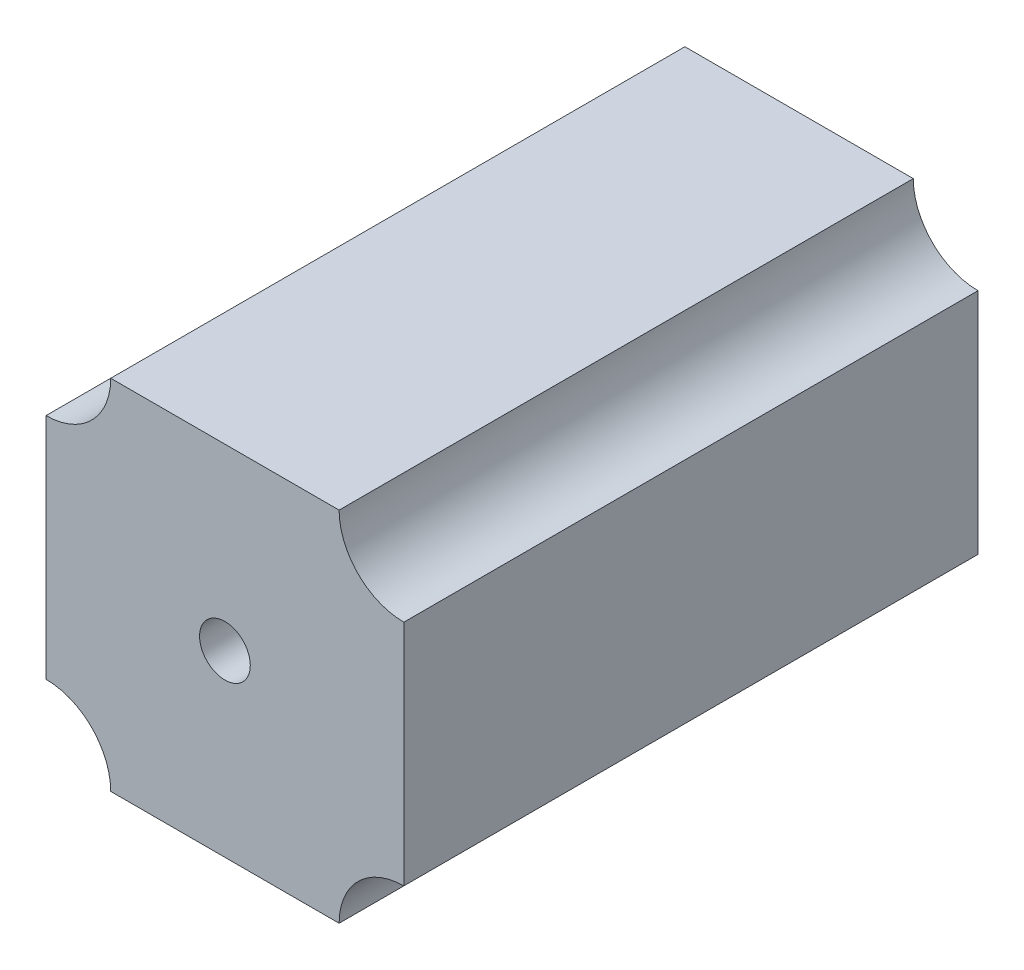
ISO-10303-21;
HEADER;
FILE_DESCRIPTION(('STEP AP214'),'2;1');
FILE_NAME('part.step','',(''),(''),'','','');
FILE_SCHEMA(('AUTOMOTIVE_DESIGN { 1 0 10303 214 1 1 1 1 }'));
ENDSEC;
DATA;
#1=APPLICATION_CONTEXT('core data for automotive mechanical design processes');
#2=APPLICATION_PROTOCOL_DEFINITION('international standard','automotive_design',2000,#1);
#3=PRODUCT_CONTEXT('',#1,'mechanical');
#4=PRODUCT('Part','Part','',(#3));
#5=PRODUCT_RELATED_PRODUCT_CATEGORY('part','',(#4));
#6=PRODUCT_DEFINITION_FORMATION('','',#4);
#7=PRODUCT_DEFINITION_CONTEXT('part definition',#1,'design');
#8=PRODUCT_DEFINITION('design','',#6,#7);
#9=PRODUCT_DEFINITION_SHAPE('','',#8);
#10=(LENGTH_UNIT() NAMED_UNIT(*) SI_UNIT(.MILLI.,.METRE.));
#11=(NAMED_UNIT(*) PLANE_ANGLE_UNIT() SI_UNIT($,.RADIAN.));
#12=(NAMED_UNIT(*) SI_UNIT($,.STERADIAN.) SOLID_ANGLE_UNIT());
#13=UNCERTAINTY_MEASURE_WITH_UNIT(LENGTH_MEASURE(1.E-05),#10,'distance_accuracy_value','');
#14=(GEOMETRIC_REPRESENTATION_CONTEXT(3) GLOBAL_UNCERTAINTY_ASSIGNED_CONTEXT((#13)) GLOBAL_UNIT_ASSIGNED_CONTEXT((#10,
#11,#12)) REPRESENTATION_CONTEXT('',''));
#15=CARTESIAN_POINT('',(0.,0.,0.));
#16=DIRECTION('',(0.,0.,1.));
#17=DIRECTION('',(1.,0.,0.));
#18=AXIS2_PLACEMENT_3D('',#15,#16,#17);
#19=CARTESIAN_POINT('',(-28.2,28.2,90.5));
#20=DIRECTION('',(0.,0.,-1.));
#21=DIRECTION('',(-1.,0.,0.));
#22=AXIS2_PLACEMENT_3D('',#19,#20,#21);
#23=CYLINDRICAL_SURFACE('',#22,10.2);
#24=CARTESIAN_POINT('',(-28.2,28.2,0.));
#25=DIRECTION('',(0.,0.,-1.));
#26=DIRECTION('',(1.,0.,0.));
#27=AXIS2_PLACEMENT_3D('',#24,#25,#26);
#28=CIRCLE('',#27,10.2);
#29=CARTESIAN_POINT('',(-18.,28.2,0.));
#30=VERTEX_POINT('',#29);
#31=CARTESIAN_POINT('',(-28.2,18.,0.));
#32=VERTEX_POINT('',#31);
#33=EDGE_CURVE('E129',#30,#32,#28,.T.);
#34=ORIENTED_EDGE('',*,*,#33,.T.);
#35=DIRECTION('',(0.,0.,-1.));
#36=VECTOR('',#35,1.);
#37=CARTESIAN_POINT('',(-28.2,18.,90.5));
#38=LINE('',#37,#36);
#39=CARTESIAN_POINT('',(-28.2,18.,90.5));
#40=VERTEX_POINT('',#39);
#41=EDGE_CURVE('E11',#40,#32,#38,.T.);
#42=ORIENTED_EDGE('',*,*,#41,.F.);
#43=CARTESIAN_POINT('',(-28.2,28.2,90.5));
#44=DIRECTION('',(0.,0.,-1.));
#45=DIRECTION('',(1.,0.,0.));
#46=AXIS2_PLACEMENT_3D('',#43,#44,#45);
#47=CIRCLE('',#46,10.2);
#48=CARTESIAN_POINT('',(-18.,28.2,90.5));
#49=VERTEX_POINT('',#48);
#50=EDGE_CURVE('E144',#49,#40,#47,.T.);
#51=ORIENTED_EDGE('',*,*,#50,.F.);
#52=DIRECTION('',(0.,0.,-1.));
#53=VECTOR('',#52,1.);
#54=CARTESIAN_POINT('',(-18.,28.2,90.5));
#55=LINE('',#54,#53);
#56=EDGE_CURVE('E125',#49,#30,#55,.T.);
#57=ORIENTED_EDGE('',*,*,#56,.T.);
#58=EDGE_LOOP('',(#34,#42,#51,#57));
#59=FACE_BOUND('',#58,.T.);
#60=ADVANCED_FACE('F33',(#59),#23,.F.);
#61=CARTESIAN_POINT('',(-28.2,-18.,90.5));
#62=DIRECTION('',(1.,0.,0.));
#63=DIRECTION('',(0.,0.,-1.));
#64=AXIS2_PLACEMENT_3D('',#61,#62,#63);
#65=PLANE('',#64);
#66=DIRECTION('',(0.,-1.,0.));
#67=VECTOR('',#66,1.);
#68=CARTESIAN_POINT('',(-28.2,-18.,0.));
#69=LINE('',#68,#67);
#70=CARTESIAN_POINT('',(-28.2,-18.,0.));
#71=VERTEX_POINT('',#70);
#72=EDGE_CURVE('E132',#32,#71,#69,.T.);
#73=ORIENTED_EDGE('',*,*,#72,.T.);
#74=DIRECTION('',(0.,0.,-1.));
#75=VECTOR('',#74,1.);
#76=CARTESIAN_POINT('',(-28.2,-18.,90.5));
#77=LINE('',#76,#75);
#78=CARTESIAN_POINT('',(-28.2,-18.,90.5));
#79=VERTEX_POINT('',#78);
#80=EDGE_CURVE('E41',#79,#71,#77,.T.);
#81=ORIENTED_EDGE('',*,*,#80,.F.);
#82=DIRECTION('',(0.,-1.,0.));
#83=VECTOR('',#82,1.);
#84=CARTESIAN_POINT('',(-28.2,-18.,90.5));
#85=LINE('',#84,#83);
#86=EDGE_CURVE('E92',#40,#79,#85,.T.);
#87=ORIENTED_EDGE('',*,*,#86,.F.);
#88=ORIENTED_EDGE('',*,*,#41,.T.);
#89=EDGE_LOOP('',(#73,#81,#87,#88));
#90=FACE_BOUND('',#89,.T.);
#91=ADVANCED_FACE('F200',(#90),#65,.F.);
#92=CARTESIAN_POINT('',(-28.2,-28.2,90.5));
#93=DIRECTION('',(0.,0.,-1.));
#94=DIRECTION('',(-1.,0.,0.));
#95=AXIS2_PLACEMENT_3D('',#92,#93,#94);
#96=CYLINDRICAL_SURFACE('',#95,10.2);
#97=CARTESIAN_POINT('',(-28.2,-28.2,0.));
#98=DIRECTION('',(0.,0.,-1.));
#99=DIRECTION('',(-1.,0.,0.));
#100=AXIS2_PLACEMENT_3D('',#97,#98,#99);
#101=CIRCLE('',#100,10.2);
#102=CARTESIAN_POINT('',(-18.,-28.2,0.));
#103=VERTEX_POINT('',#102);
#104=EDGE_CURVE('E135',#71,#103,#101,.T.);
#105=ORIENTED_EDGE('',*,*,#104,.T.);
#106=DIRECTION('',(0.,0.,-1.));
#107=VECTOR('',#106,1.);
#108=CARTESIAN_POINT('',(-18.,-28.2,90.5));
#109=LINE('',#108,#107);
#110=CARTESIAN_POINT('',(-18.,-28.2,90.5));
#111=VERTEX_POINT('',#110);
#112=EDGE_CURVE('E151',#111,#103,#109,.T.);
#113=ORIENTED_EDGE('',*,*,#112,.F.);
#114=CARTESIAN_POINT('',(-28.2,-28.2,90.5));
#115=DIRECTION('',(0.,0.,-1.));
#116=DIRECTION('',(-1.,0.,0.));
#117=AXIS2_PLACEMENT_3D('',#114,#115,#116);
#118=CIRCLE('',#117,10.2);
#119=EDGE_CURVE('E159',#79,#111,#118,.T.);
#120=ORIENTED_EDGE('',*,*,#119,.F.);
#121=ORIENTED_EDGE('',*,*,#80,.T.);
#122=EDGE_LOOP('',(#105,#113,#120,#121));
#123=FACE_BOUND('',#122,.T.);
#124=ADVANCED_FACE('F157',(#123),#96,.F.);
#125=CARTESIAN_POINT('',(18.,-28.2,90.5));
#126=DIRECTION('',(0.,1.,0.));
#127=DIRECTION('',(0.,0.,1.));
#128=AXIS2_PLACEMENT_3D('',#125,#126,#127);
#129=PLANE('',#128);
#130=DIRECTION('',(1.,0.,0.));
#131=VECTOR('',#130,1.);
#132=CARTESIAN_POINT('',(18.,-28.2,0.));
#133=LINE('',#132,#131);
#134=CARTESIAN_POINT('',(18.,-28.2,0.));
#135=VERTEX_POINT('',#134);
#136=EDGE_CURVE('E137',#103,#135,#133,.T.);
#137=ORIENTED_EDGE('',*,*,#136,.T.);
#138=DIRECTION('',(0.,0.,-1.));
#139=VECTOR('',#138,1.);
#140=CARTESIAN_POINT('',(18.,-28.2,90.5));
#141=LINE('',#140,#139);
#142=CARTESIAN_POINT('',(18.,-28.2,90.5));
#143=VERTEX_POINT('',#142);
#144=EDGE_CURVE('E148',#143,#135,#141,.T.);
#145=ORIENTED_EDGE('',*,*,#144,.F.);
#146=DIRECTION('',(1.,0.,0.));
#147=VECTOR('',#146,1.);
#148=CARTESIAN_POINT('',(18.,-28.2,90.5));
#149=LINE('',#148,#147);
#150=EDGE_CURVE('E171',#111,#143,#149,.T.);
#151=ORIENTED_EDGE('',*,*,#150,.F.);
#152=ORIENTED_EDGE('',*,*,#112,.T.);
#153=EDGE_LOOP('',(#137,#145,#151,#152));
#154=FACE_BOUND('',#153,.T.);
#155=ADVANCED_FACE('F167',(#154),#129,.F.);
#156=CARTESIAN_POINT('',(28.2,-28.2,90.5));
#157=DIRECTION('',(0.,0.,-1.));
#158=DIRECTION('',(-1.,0.,0.));
#159=AXIS2_PLACEMENT_3D('',#156,#157,#158);
#160=CYLINDRICAL_SURFACE('',#159,10.2);
#161=CARTESIAN_POINT('',(28.2,-28.2,0.));
#162=DIRECTION('',(0.,0.,-1.));
#163=DIRECTION('',(1.,0.,0.));
#164=AXIS2_PLACEMENT_3D('',#161,#162,#163);
#165=CIRCLE('',#164,10.2);
#166=CARTESIAN_POINT('',(28.2,-18.,0.));
#167=VERTEX_POINT('',#166);
#168=EDGE_CURVE('E139',#135,#167,#165,.T.);
#169=ORIENTED_EDGE('',*,*,#168,.T.);
#170=DIRECTION('',(0.,0.,-1.));
#171=VECTOR('',#170,1.);
#172=CARTESIAN_POINT('',(28.2,-18.,90.5));
#173=LINE('',#172,#171);
#174=CARTESIAN_POINT('',(28.2,-18.,90.5));
#175=VERTEX_POINT('',#174);
#176=EDGE_CURVE('E120',#175,#167,#173,.T.);
#177=ORIENTED_EDGE('',*,*,#176,.F.);
#178=CARTESIAN_POINT('',(28.2,-28.2,90.5));
#179=DIRECTION('',(0.,0.,-1.));
#180=DIRECTION('',(1.,0.,0.));
#181=AXIS2_PLACEMENT_3D('',#178,#179,#180);
#182=CIRCLE('',#181,10.2);
#183=EDGE_CURVE('E111',#143,#175,#182,.T.);
#184=ORIENTED_EDGE('',*,*,#183,.F.);
#185=ORIENTED_EDGE('',*,*,#144,.T.);
#186=EDGE_LOOP('',(#169,#177,#184,#185));
#187=FACE_BOUND('',#186,.T.);
#188=ADVANCED_FACE('F170',(#187),#160,.F.);
#189=CARTESIAN_POINT('',(28.2,-18.,90.5));
#190=DIRECTION('',(-1.,0.,0.));
#191=DIRECTION('',(0.,0.,1.));
#192=AXIS2_PLACEMENT_3D('',#189,#190,#191);
#193=PLANE('',#192);
#194=DIRECTION('',(0.,1.,0.));
#195=VECTOR('',#194,1.);
#196=CARTESIAN_POINT('',(28.2,-18.,0.));
#197=LINE('',#196,#195);
#198=CARTESIAN_POINT('',(28.2,18.,0.));
#199=VERTEX_POINT('',#198);
#200=EDGE_CURVE('E119',#167,#199,#197,.T.);
#201=ORIENTED_EDGE('',*,*,#200,.T.);
#202=DIRECTION('',(0.,0.,-1.));
#203=VECTOR('',#202,1.);
#204=CARTESIAN_POINT('',(28.2,18.,90.5));
#205=LINE('',#204,#203);
#206=CARTESIAN_POINT('',(28.2,18.,90.5));
#207=VERTEX_POINT('',#206);
#208=EDGE_CURVE('E116',#207,#199,#205,.T.);
#209=ORIENTED_EDGE('',*,*,#208,.F.);
#210=DIRECTION('',(0.,1.,0.));
#211=VECTOR('',#210,1.);
#212=CARTESIAN_POINT('',(28.2,-18.,90.5));
#213=LINE('',#212,#211);
#214=EDGE_CURVE('E105',#175,#207,#213,.T.);
#215=ORIENTED_EDGE('',*,*,#214,.F.);
#216=ORIENTED_EDGE('',*,*,#176,.T.);
#217=EDGE_LOOP('',(#201,#209,#215,#216));
#218=FACE_BOUND('',#217,.T.);
#219=ADVANCED_FACE('F117',(#218),#193,.F.);
#220=CARTESIAN_POINT('',(28.2,28.2,90.5));
#221=DIRECTION('',(0.,0.,-1.));
#222=DIRECTION('',(-1.,0.,0.));
#223=AXIS2_PLACEMENT_3D('',#220,#221,#222);
#224=CYLINDRICAL_SURFACE('',#223,10.2);
#225=CARTESIAN_POINT('',(28.2,28.2,0.));
#226=DIRECTION('',(0.,0.,-1.));
#227=DIRECTION('',(1.,0.,0.));
#228=AXIS2_PLACEMENT_3D('',#225,#226,#227);
#229=CIRCLE('',#228,10.2);
#230=CARTESIAN_POINT('',(18.,28.2,0.));
#231=VERTEX_POINT('',#230);
#232=EDGE_CURVE('E78',#199,#231,#229,.T.);
#233=ORIENTED_EDGE('',*,*,#232,.T.);
#234=DIRECTION('',(0.,0.,-1.));
#235=VECTOR('',#234,1.);
#236=CARTESIAN_POINT('',(18.,28.2,90.5));
#237=LINE('',#236,#235);
#238=CARTESIAN_POINT('',(18.,28.2,90.5));
#239=VERTEX_POINT('',#238);
#240=EDGE_CURVE('E121',#239,#231,#237,.T.);
#241=ORIENTED_EDGE('',*,*,#240,.F.);
#242=CARTESIAN_POINT('',(28.2,28.2,90.5));
#243=DIRECTION('',(0.,0.,-1.));
#244=DIRECTION('',(1.,0.,0.));
#245=AXIS2_PLACEMENT_3D('',#242,#243,#244);
#246=CIRCLE('',#245,10.2);
#247=EDGE_CURVE('E109',#207,#239,#246,.T.);
#248=ORIENTED_EDGE('',*,*,#247,.F.);
#249=ORIENTED_EDGE('',*,*,#208,.T.);
#250=EDGE_LOOP('',(#233,#241,#248,#249));
#251=FACE_BOUND('',#250,.T.);
#252=ADVANCED_FACE('F123',(#251),#224,.F.);
#253=CARTESIAN_POINT('',(18.,28.2,90.5));
#254=DIRECTION('',(0.,-1.,0.));
#255=DIRECTION('',(0.,0.,-1.));
#256=AXIS2_PLACEMENT_3D('',#253,#254,#255);
#257=PLANE('',#256);
#258=DIRECTION('',(-1.,0.,0.));
#259=VECTOR('',#258,1.);
#260=CARTESIAN_POINT('',(18.,28.2,0.));
#261=LINE('',#260,#259);
#262=EDGE_CURVE('E84',#231,#30,#261,.T.);
#263=ORIENTED_EDGE('',*,*,#262,.T.);
#264=ORIENTED_EDGE('',*,*,#56,.F.);
#265=DIRECTION('',(-1.,0.,0.));
#266=VECTOR('',#265,1.);
#267=CARTESIAN_POINT('',(18.,28.2,90.5));
#268=LINE('',#267,#266);
#269=EDGE_CURVE('E49',#239,#49,#268,.T.);
#270=ORIENTED_EDGE('',*,*,#269,.F.);
#271=ORIENTED_EDGE('',*,*,#240,.T.);
#272=EDGE_LOOP('',(#263,#264,#270,#271));
#273=FACE_BOUND('',#272,.T.);
#274=ADVANCED_FACE('F191',(#273),#257,.F.);
#275=CARTESIAN_POINT('',(-28.2,28.2,90.5));
#276=DIRECTION('',(0.,0.,1.));
#277=DIRECTION('',(1.,0.,0.));
#278=AXIS2_PLACEMENT_3D('',#275,#276,#277);
#279=PLANE('',#278);
#280=CARTESIAN_POINT('',(0.,0.,90.5));
#281=DIRECTION('',(0.,0.,1.));
#282=DIRECTION('',(1.,0.,0.));
#283=AXIS2_PLACEMENT_3D('',#280,#281,#282);
#284=CIRCLE('',#283,4.);
#285=CARTESIAN_POINT('',(4.,0.,90.5));
#286=VERTEX_POINT('',#285);
#287=EDGE_CURVE('E177',#286,#286,#284,.T.);
#288=ORIENTED_EDGE('',*,*,#287,.F.);
#289=EDGE_LOOP('',(#288));
#290=FACE_BOUND('',#289,.T.);
#291=ORIENTED_EDGE('',*,*,#50,.T.);
#292=ORIENTED_EDGE('',*,*,#86,.T.);
#293=ORIENTED_EDGE('',*,*,#119,.T.);
#294=ORIENTED_EDGE('',*,*,#150,.T.);
#295=ORIENTED_EDGE('',*,*,#183,.T.);
#296=ORIENTED_EDGE('',*,*,#214,.T.);
#297=ORIENTED_EDGE('',*,*,#247,.T.);
#298=ORIENTED_EDGE('',*,*,#269,.T.);
#299=EDGE_LOOP('',(#291,#292,#293,#294,#295,#296,#297,#298));
#300=FACE_BOUND('',#299,.T.);
#301=ADVANCED_FACE('F107',(#290,#300),#279,.T.);
#302=CARTESIAN_POINT('',(-28.2,28.2,0.));
#303=DIRECTION('',(0.,0.,1.));
#304=DIRECTION('',(1.,0.,0.));
#305=AXIS2_PLACEMENT_3D('',#302,#303,#304);
#306=PLANE('',#305);
#307=CARTESIAN_POINT('',(0.,0.,0.));
#308=DIRECTION('',(0.,0.,1.));
#309=DIRECTION('',(1.,0.,0.));
#310=AXIS2_PLACEMENT_3D('',#307,#308,#309);
#311=CIRCLE('',#310,4.);
#312=CARTESIAN_POINT('',(4.,0.,0.));
#313=VERTEX_POINT('',#312);
#314=EDGE_CURVE('E133',#313,#313,#311,.T.);
#315=ORIENTED_EDGE('',*,*,#314,.T.);
#316=EDGE_LOOP('',(#315));
#317=FACE_BOUND('',#316,.T.);
#318=ORIENTED_EDGE('',*,*,#33,.F.);
#319=ORIENTED_EDGE('',*,*,#262,.F.);
#320=ORIENTED_EDGE('',*,*,#232,.F.);
#321=ORIENTED_EDGE('',*,*,#200,.F.);
#322=ORIENTED_EDGE('',*,*,#168,.F.);
#323=ORIENTED_EDGE('',*,*,#136,.F.);
#324=ORIENTED_EDGE('',*,*,#104,.F.);
#325=ORIENTED_EDGE('',*,*,#72,.F.);
#326=EDGE_LOOP('',(#318,#319,#320,#321,#322,#323,#324,#325));
#327=FACE_BOUND('',#326,.T.);
#328=ADVANCED_FACE('F163',(#317,#327),#306,.F.);
#329=CARTESIAN_POINT('',(0.,0.,0.));
#330=DIRECTION('',(0.,0.,1.));
#331=DIRECTION('',(1.,0.,0.));
#332=AXIS2_PLACEMENT_3D('',#329,#330,#331);
#333=CYLINDRICAL_SURFACE('',#332,4.);
#334=ORIENTED_EDGE('',*,*,#314,.F.);
#335=EDGE_LOOP('',(#334));
#336=FACE_BOUND('',#335,.T.);
#337=ORIENTED_EDGE('',*,*,#287,.T.);
#338=EDGE_LOOP('',(#337));
#339=FACE_BOUND('',#338,.T.);
#340=ADVANCED_FACE('F184',(#336,#339),#333,.F.);
#341=CLOSED_SHELL('',(#60,#91,#124,#155,#188,#219,#252,#274,#301,#328,#340));
#342=MANIFOLD_SOLID_BREP('B2',#341);
#343=ADVANCED_BREP_SHAPE_REPRESENTATION('',(#18,#342),#14);
#344=SHAPE_DEFINITION_REPRESENTATION(#9,#343);
ENDSEC;
END-ISO-10303-21;
